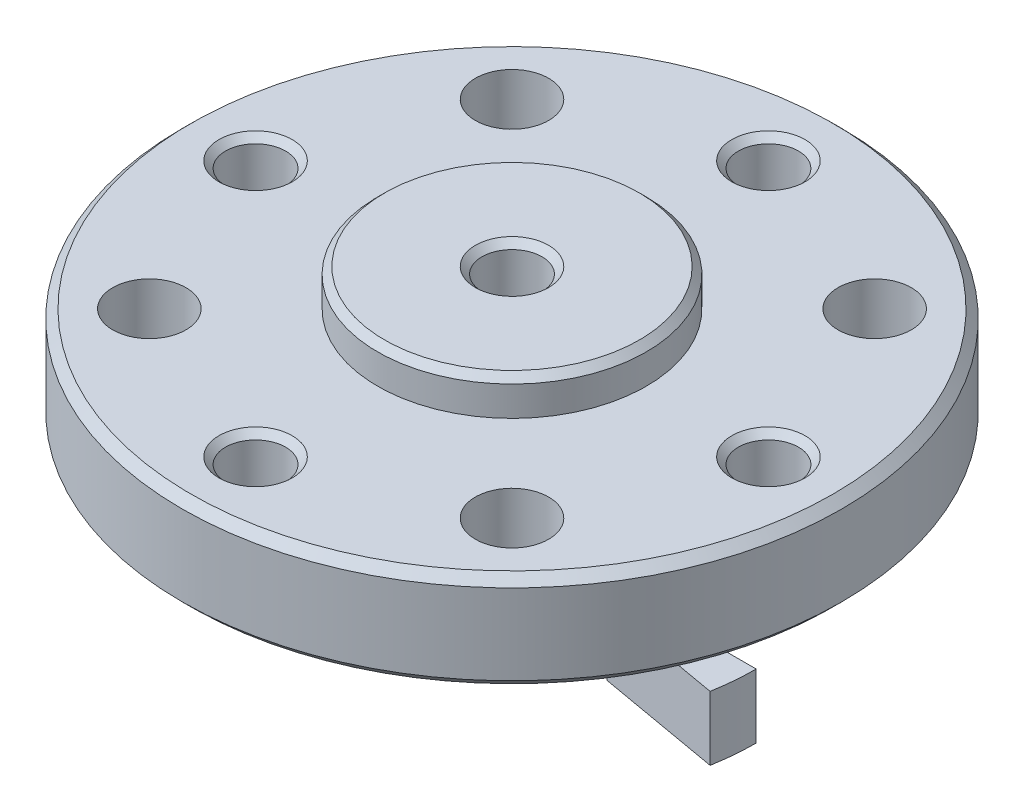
ISO-10303-21;
HEADER;
FILE_DESCRIPTION(('STEP AP214'),'2;1');
FILE_NAME('part.step','',(''),(''),'','','');
FILE_SCHEMA(('AUTOMOTIVE_DESIGN { 1 0 10303 214 1 1 1 1 }'));
ENDSEC;
DATA;
#1=APPLICATION_CONTEXT('core data for automotive mechanical design processes');
#2=APPLICATION_PROTOCOL_DEFINITION('international standard','automotive_design',2000,#1);
#3=PRODUCT_CONTEXT('',#1,'mechanical');
#4=PRODUCT('Part','Part','',(#3));
#5=PRODUCT_RELATED_PRODUCT_CATEGORY('part','',(#4));
#6=PRODUCT_DEFINITION_FORMATION('','',#4);
#7=PRODUCT_DEFINITION_CONTEXT('part definition',#1,'design');
#8=PRODUCT_DEFINITION('design','',#6,#7);
#9=PRODUCT_DEFINITION_SHAPE('','',#8);
#10=(LENGTH_UNIT() NAMED_UNIT(*) SI_UNIT(.MILLI.,.METRE.));
#11=(NAMED_UNIT(*) PLANE_ANGLE_UNIT() SI_UNIT($,.RADIAN.));
#12=(NAMED_UNIT(*) SI_UNIT($,.STERADIAN.) SOLID_ANGLE_UNIT());
#13=UNCERTAINTY_MEASURE_WITH_UNIT(LENGTH_MEASURE(1.E-05),#10,'distance_accuracy_value','');
#14=(GEOMETRIC_REPRESENTATION_CONTEXT(3) GLOBAL_UNCERTAINTY_ASSIGNED_CONTEXT((#13)) GLOBAL_UNIT_ASSIGNED_CONTEXT((#10,
#11,#12)) REPRESENTATION_CONTEXT('',''));
#15=CARTESIAN_POINT('',(0.,0.,0.));
#16=DIRECTION('',(0.,0.,1.));
#17=DIRECTION('',(1.,0.,0.));
#18=AXIS2_PLACEMENT_3D('',#15,#16,#17);
#19=CARTESIAN_POINT('',(0.,18.2,-44.6585786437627));
#20=DIRECTION('',(0.,1.,0.));
#21=DIRECTION('',(0.,0.,1.));
#22=AXIS2_PLACEMENT_3D('',#19,#20,#21);
#23=PLANE('',#22);
#24=CARTESIAN_POINT('',(0.,18.1999999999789,-42.05));
#25=DIRECTION('',(0.,-1.,0.));
#26=DIRECTION('',(0.,0.,-1.));
#27=AXIS2_PLACEMENT_3D('',#24,#25,#26);
#28=CIRCLE('',#27,5.21715728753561);
#29=CARTESIAN_POINT('',(0.,18.1999999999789,-47.2671572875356));
#30=VERTEX_POINT('',#29);
#31=EDGE_CURVE('E163',#30,#30,#28,.T.);
#32=ORIENTED_EDGE('',*,*,#31,.F.);
#33=EDGE_LOOP('',(#32));
#34=FACE_BOUND('',#33,.T.);
#35=CARTESIAN_POINT('',(0.,18.1999999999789,-42.05));
#36=DIRECTION('',(0.,1.,0.));
#37=DIRECTION('',(0.,0.,1.));
#38=AXIS2_PLACEMENT_3D('',#35,#36,#37);
#39=CIRCLE('',#38,1.50000000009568);
#40=CARTESIAN_POINT('',(0.,18.1999999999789,-40.5499999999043));
#41=VERTEX_POINT('',#40);
#42=EDGE_CURVE('E19',#41,#41,#39,.F.);
#43=ORIENTED_EDGE('',*,*,#42,.T.);
#44=EDGE_LOOP('',(#43));
#45=FACE_BOUND('',#44,.T.);
#46=ADVANCED_FACE('F16',(#34,#45),#23,.T.);
#47=CARTESIAN_POINT('',(7.4,7.6125,-42.05));
#48=DIRECTION('',(0.,0.,1.));
#49=DIRECTION('',(0.,-1.,0.));
#50=AXIS2_PLACEMENT_3D('',#47,#48,#49);
#51=PLANE('',#50);
#52=DIRECTION('',(1.,0.,0.));
#53=VECTOR('',#52,1.);
#54=CARTESIAN_POINT('',(7.28757737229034,8.925,-42.05));
#55=LINE('',#54,#53);
#56=CARTESIAN_POINT('',(10.,8.925,-42.05));
#57=VERTEX_POINT('',#56);
#58=CARTESIAN_POINT('',(5.,8.925,-42.05));
#59=VERTEX_POINT('',#58);
#60=EDGE_CURVE('E208',#57,#59,#55,.F.);
#61=ORIENTED_EDGE('',*,*,#60,.F.);
#62=DIRECTION('',(0.,-1.,0.));
#63=VECTOR('',#62,1.);
#64=CARTESIAN_POINT('',(10.,7.6125,-42.05));
#65=LINE('',#64,#63);
#66=CARTESIAN_POINT('',(10.,6.3,-42.05));
#67=VERTEX_POINT('',#66);
#68=EDGE_CURVE('E239',#67,#57,#65,.F.);
#69=ORIENTED_EDGE('',*,*,#68,.F.);
#70=DIRECTION('',(1.,0.,0.));
#71=VECTOR('',#70,1.);
#72=CARTESIAN_POINT('',(7.28757737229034,6.3,-42.05));
#73=LINE('',#72,#71);
#74=CARTESIAN_POINT('',(4.8,6.3,-42.05));
#75=VERTEX_POINT('',#74);
#76=EDGE_CURVE('E224',#75,#67,#73,.T.);
#77=ORIENTED_EDGE('',*,*,#76,.F.);
#78=DIRECTION('',(0.,-1.,0.));
#79=VECTOR('',#78,1.);
#80=CARTESIAN_POINT('',(4.8,7.6125,-42.05));
#81=LINE('',#80,#79);
#82=CARTESIAN_POINT('',(4.8,8.3,-42.05));
#83=VERTEX_POINT('',#82);
#84=EDGE_CURVE('E242',#75,#83,#81,.F.);
#85=ORIENTED_EDGE('',*,*,#84,.T.);
#86=DIRECTION('',(1.,0.,0.));
#87=VECTOR('',#86,1.);
#88=CARTESIAN_POINT('',(7.4,8.3,-42.05));
#89=LINE('',#88,#87);
#90=CARTESIAN_POINT('',(5.,8.3,-42.05));
#91=VERTEX_POINT('',#90);
#92=EDGE_CURVE('E238',#91,#83,#89,.F.);
#93=ORIENTED_EDGE('',*,*,#92,.F.);
#94=DIRECTION('',(0.,-1.,0.));
#95=VECTOR('',#94,1.);
#96=CARTESIAN_POINT('',(5.,7.6125,-42.05));
#97=LINE('',#96,#95);
#98=EDGE_CURVE('E235',#59,#91,#97,.T.);
#99=ORIENTED_EDGE('',*,*,#98,.F.);
#100=EDGE_LOOP('',(#61,#69,#77,#85,#93,#99));
#101=FACE_BOUND('',#100,.T.);
#102=ADVANCED_FACE('F506',(#101),#51,.F.);
#103=CARTESIAN_POINT('',(0.,18.1999999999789,-42.05));
#104=DIRECTION('',(0.,1.,0.));
#105=DIRECTION('',(0.,0.,1.));
#106=AXIS2_PLACEMENT_3D('',#103,#104,#105);
#107=CONICAL_SURFACE('',#106,1.50000000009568,0.785398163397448);
#108=CARTESIAN_POINT('',(0.,17.9295,-42.05));
#109=DIRECTION('',(0.,-1.,0.));
#110=DIRECTION('',(0.,0.,-1.));
#111=AXIS2_PLACEMENT_3D('',#108,#109,#110);
#112=CIRCLE('',#111,1.2295);
#113=CARTESIAN_POINT('',(0.,17.9295,-43.2795));
#114=VERTEX_POINT('',#113);
#115=EDGE_CURVE('E211',#114,#114,#112,.T.);
#116=ORIENTED_EDGE('',*,*,#115,.T.);
#117=EDGE_LOOP('',(#116));
#118=FACE_BOUND('',#117,.T.);
#119=ORIENTED_EDGE('',*,*,#42,.F.);
#120=EDGE_LOOP('',(#119));
#121=FACE_BOUND('',#120,.T.);
#122=ADVANCED_FACE('F527',(#118,#121),#107,.F.);
#123=CARTESIAN_POINT('',(0.,17.9171572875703,-42.05));
#124=DIRECTION('',(0.,-1.,0.));
#125=DIRECTION('',(0.,0.,-1.));
#126=AXIS2_PLACEMENT_3D('',#123,#124,#125);
#127=CONICAL_SURFACE('',#126,5.49999999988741,0.785398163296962);
#128=ORIENTED_EDGE('',*,*,#31,.T.);
#129=EDGE_LOOP('',(#128));
#130=FACE_BOUND('',#129,.T.);
#131=CARTESIAN_POINT('',(0.,17.9171572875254,-42.05));
#132=DIRECTION('',(0.,-1.,0.));
#133=DIRECTION('',(0.,0.,-1.));
#134=AXIS2_PLACEMENT_3D('',#131,#132,#133);
#135=CIRCLE('',#134,5.5);
#136=CARTESIAN_POINT('',(0.,17.9171572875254,-47.55));
#137=VERTEX_POINT('',#136);
#138=EDGE_CURVE('E207',#137,#137,#135,.T.);
#139=ORIENTED_EDGE('',*,*,#138,.F.);
#140=EDGE_LOOP('',(#139));
#141=FACE_BOUND('',#140,.T.);
#142=ADVANCED_FACE('F519',(#130,#141),#127,.T.);
#143=CARTESIAN_POINT('',(0.,7.6125,-42.05));
#144=DIRECTION('',(0.,-1.,0.));
#145=DIRECTION('',(0.,0.,-1.));
#146=AXIS2_PLACEMENT_3D('',#143,#144,#145);
#147=CYLINDRICAL_SURFACE('',#146,4.8);
#148=ORIENTED_EDGE('',*,*,#84,.F.);
#149=CARTESIAN_POINT('',(0.,6.3,-42.05));
#150=DIRECTION('',(0.,-1.,0.));
#151=DIRECTION('',(0.,0.,-1.));
#152=AXIS2_PLACEMENT_3D('',#149,#150,#151);
#153=CIRCLE('',#152,4.8);
#154=CARTESIAN_POINT('',(4.7270772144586,6.3,-41.2164887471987));
#155=VERTEX_POINT('',#154);
#156=EDGE_CURVE('E227',#155,#75,#153,.F.);
#157=ORIENTED_EDGE('',*,*,#156,.F.);
#158=DIRECTION('',(0.,1.,0.));
#159=VECTOR('',#158,1.);
#160=CARTESIAN_POINT('',(4.7270772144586,7.6125,-41.2164887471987));
#161=LINE('',#160,#159);
#162=CARTESIAN_POINT('',(4.7270772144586,8.3,-41.2164887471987));
#163=VERTEX_POINT('',#162);
#164=EDGE_CURVE('E223',#163,#155,#161,.F.);
#165=ORIENTED_EDGE('',*,*,#164,.F.);
#166=CARTESIAN_POINT('',(0.,8.3,-42.05));
#167=DIRECTION('',(0.,-1.,0.));
#168=DIRECTION('',(0.,0.,-1.));
#169=AXIS2_PLACEMENT_3D('',#166,#167,#168);
#170=CIRCLE('',#169,4.8);
#171=EDGE_CURVE('E228',#83,#163,#170,.T.);
#172=ORIENTED_EDGE('',*,*,#171,.F.);
#173=EDGE_LOOP('',(#148,#157,#165,#172));
#174=FACE_BOUND('',#173,.T.);
#175=ADVANCED_FACE('F512',(#174),#147,.F.);
#176=CARTESIAN_POINT('',(7.28757737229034,6.3,-40.7650034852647));
#177=DIRECTION('',(0.,-1.,0.));
#178=DIRECTION('',(0.,0.,-1.));
#179=AXIS2_PLACEMENT_3D('',#176,#177,#178);
#180=PLANE('',#179);
#181=DIRECTION('',(0.984807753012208,0.,0.17364817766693));
#182=VECTOR('',#181,1.);
#183=CARTESIAN_POINT('',(7.28757737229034,6.3,-40.7650034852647));
#184=LINE('',#183,#182);
#185=CARTESIAN_POINT('',(9.84807753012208,6.3,-40.3135182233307));
#186=VERTEX_POINT('',#185);
#187=EDGE_CURVE('E217',#155,#186,#184,.T.);
#188=ORIENTED_EDGE('',*,*,#187,.F.);
#189=ORIENTED_EDGE('',*,*,#156,.T.);
#190=ORIENTED_EDGE('',*,*,#76,.T.);
#191=CARTESIAN_POINT('',(0.,6.3,-42.05));
#192=DIRECTION('',(0.,-1.,0.));
#193=DIRECTION('',(0.,0.,-1.));
#194=AXIS2_PLACEMENT_3D('',#191,#192,#193);
#195=CIRCLE('',#194,10.);
#196=EDGE_CURVE('E241',#186,#67,#195,.F.);
#197=ORIENTED_EDGE('',*,*,#196,.F.);
#198=EDGE_LOOP('',(#188,#189,#190,#197));
#199=FACE_BOUND('',#198,.T.);
#200=ADVANCED_FACE('F539',(#199),#180,.T.);
#201=CARTESIAN_POINT('',(0.,7.6125,-42.05));
#202=DIRECTION('',(0.,-1.,0.));
#203=DIRECTION('',(0.,0.,-1.));
#204=AXIS2_PLACEMENT_3D('',#201,#202,#203);
#205=CYLINDRICAL_SURFACE('',#204,10.);
#206=DIRECTION('',(0.,1.,0.));
#207=VECTOR('',#206,1.);
#208=CARTESIAN_POINT('',(9.84807753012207,7.6125,-40.3135182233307));
#209=LINE('',#208,#207);
#210=CARTESIAN_POINT('',(9.84807753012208,8.925,-40.3135182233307));
#211=VERTEX_POINT('',#210);
#212=EDGE_CURVE('E213',#186,#211,#209,.T.);
#213=ORIENTED_EDGE('',*,*,#212,.F.);
#214=ORIENTED_EDGE('',*,*,#196,.T.);
#215=ORIENTED_EDGE('',*,*,#68,.T.);
#216=CARTESIAN_POINT('',(0.,8.925,-42.05));
#217=DIRECTION('',(0.,-1.,0.));
#218=DIRECTION('',(0.,0.,-1.));
#219=AXIS2_PLACEMENT_3D('',#216,#217,#218);
#220=CIRCLE('',#219,10.);
#221=EDGE_CURVE('E212',#211,#57,#220,.F.);
#222=ORIENTED_EDGE('',*,*,#221,.F.);
#223=EDGE_LOOP('',(#213,#214,#215,#222));
#224=FACE_BOUND('',#223,.T.);
#225=ADVANCED_FACE('F542',(#224),#205,.T.);
#226=CARTESIAN_POINT('',(7.28757737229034,8.925,-40.7650034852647));
#227=DIRECTION('',(0.,1.,0.));
#228=DIRECTION('',(0.,0.,1.));
#229=AXIS2_PLACEMENT_3D('',#226,#227,#228);
#230=PLANE('',#229);
#231=ORIENTED_EDGE('',*,*,#221,.T.);
#232=ORIENTED_EDGE('',*,*,#60,.T.);
#233=CARTESIAN_POINT('',(0.,8.925,-42.05));
#234=DIRECTION('',(0.,-1.,0.));
#235=DIRECTION('',(0.,0.,-1.));
#236=AXIS2_PLACEMENT_3D('',#233,#234,#235);
#237=CIRCLE('',#236,5.);
#238=CARTESIAN_POINT('',(4.92403876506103,8.925,-41.1817591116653));
#239=VERTEX_POINT('',#238);
#240=EDGE_CURVE('E502',#59,#239,#237,.T.);
#241=ORIENTED_EDGE('',*,*,#240,.T.);
#242=DIRECTION('',(0.984807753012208,0.,0.17364817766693));
#243=VECTOR('',#242,1.);
#244=CARTESIAN_POINT('',(7.28757737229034,8.925,-40.7650034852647));
#245=LINE('',#244,#243);
#246=EDGE_CURVE('E216',#211,#239,#245,.F.);
#247=ORIENTED_EDGE('',*,*,#246,.F.);
#248=EDGE_LOOP('',(#231,#232,#241,#247));
#249=FACE_BOUND('',#248,.T.);
#250=ADVANCED_FACE('F546',(#249),#230,.T.);
#251=CARTESIAN_POINT('',(0.,13.25,-42.05));
#252=DIRECTION('',(0.,-1.,0.));
#253=DIRECTION('',(0.,0.,-1.));
#254=AXIS2_PLACEMENT_3D('',#251,#252,#253);
#255=CYLINDRICAL_SURFACE('',#254,1.2295);
#256=CARTESIAN_POINT('',(0.,10.3,-42.05));
#257=DIRECTION('',(0.,-1.,0.));
#258=DIRECTION('',(0.,0.,-1.));
#259=AXIS2_PLACEMENT_3D('',#256,#257,#258);
#260=CIRCLE('',#259,1.2295);
#261=CARTESIAN_POINT('',(0.999999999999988,10.3,-41.3346887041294));
#262=VERTEX_POINT('',#261);
#263=CARTESIAN_POINT('',(-0.999999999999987,10.3,-41.3346887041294));
#264=VERTEX_POINT('',#263);
#265=EDGE_CURVE('E138',#262,#264,#260,.T.);
#266=ORIENTED_EDGE('',*,*,#265,.T.);
#267=DIRECTION('',(0.,-1.,0.));
#268=VECTOR('',#267,1.);
#269=CARTESIAN_POINT('',(-0.999999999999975,13.25,-41.3346887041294));
#270=LINE('',#269,#268);
#271=CARTESIAN_POINT('',(-1.,8.5705000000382,-41.3346887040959));
#272=VERTEX_POINT('',#271);
#273=EDGE_CURVE('E143',#272,#264,#270,.F.);
#274=ORIENTED_EDGE('',*,*,#273,.F.);
#275=CARTESIAN_POINT('',(0.,8.5705,-42.05));
#276=DIRECTION('',(0.,-1.,0.));
#277=DIRECTION('',(0.,0.,-1.));
#278=AXIS2_PLACEMENT_3D('',#275,#276,#277);
#279=CIRCLE('',#278,1.2295);
#280=CARTESIAN_POINT('',(-1.00000000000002,8.57050000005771,-42.7653112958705));
#281=VERTEX_POINT('',#280);
#282=EDGE_CURVE('E164',#281,#272,#279,.F.);
#283=ORIENTED_EDGE('',*,*,#282,.F.);
#284=DIRECTION('',(0.,-1.,0.));
#285=VECTOR('',#284,1.);
#286=CARTESIAN_POINT('',(-1.00000000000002,13.25,-42.7653112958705));
#287=LINE('',#286,#285);
#288=CARTESIAN_POINT('',(-1.00000000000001,10.3,-42.7653112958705));
#289=VERTEX_POINT('',#288);
#290=EDGE_CURVE('E247',#289,#281,#287,.T.);
#291=ORIENTED_EDGE('',*,*,#290,.F.);
#292=CARTESIAN_POINT('',(0.,10.3,-42.05));
#293=DIRECTION('',(0.,-1.,0.));
#294=DIRECTION('',(0.,0.,-1.));
#295=AXIS2_PLACEMENT_3D('',#292,#293,#294);
#296=CIRCLE('',#295,1.2295);
#297=CARTESIAN_POINT('',(1.00000000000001,10.3,-42.7653112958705));
#298=VERTEX_POINT('',#297);
#299=EDGE_CURVE('E220',#289,#298,#296,.T.);
#300=ORIENTED_EDGE('',*,*,#299,.T.);
#301=DIRECTION('',(0.,-1.,0.));
#302=VECTOR('',#301,1.);
#303=CARTESIAN_POINT('',(1.00000000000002,13.25,-42.7653112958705));
#304=LINE('',#303,#302);
#305=CARTESIAN_POINT('',(1.00000000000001,8.57050000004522,-42.7653112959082));
#306=VERTEX_POINT('',#305);
#307=EDGE_CURVE('E205',#306,#298,#304,.F.);
#308=ORIENTED_EDGE('',*,*,#307,.F.);
#309=CARTESIAN_POINT('',(0.,8.57050000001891,-42.05));
#310=DIRECTION('',(0.,-1.,0.));
#311=DIRECTION('',(0.,0.,-1.));
#312=AXIS2_PLACEMENT_3D('',#309,#310,#311);
#313=CIRCLE('',#312,1.22950000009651);
#314=CARTESIAN_POINT('',(0.999999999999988,8.57050000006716,-41.3346887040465));
#315=VERTEX_POINT('',#314);
#316=EDGE_CURVE('E468',#306,#315,#313,.T.);
#317=ORIENTED_EDGE('',*,*,#316,.T.);
#318=DIRECTION('',(0.,-1.,0.));
#319=VECTOR('',#318,1.);
#320=CARTESIAN_POINT('',(0.999999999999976,13.25,-41.3346887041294));
#321=LINE('',#320,#319);
#322=EDGE_CURVE('E146',#262,#315,#321,.T.);
#323=ORIENTED_EDGE('',*,*,#322,.F.);
#324=EDGE_LOOP('',(#266,#274,#283,#291,#300,#308,#317,#323));
#325=FACE_BOUND('',#324,.T.);
#326=ORIENTED_EDGE('',*,*,#115,.F.);
#327=EDGE_LOOP('',(#326));
#328=FACE_BOUND('',#327,.T.);
#329=ADVANCED_FACE('F140',(#325,#328),#255,.F.);
#330=CARTESIAN_POINT('',(0.,17.3085786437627,-42.05));
#331=DIRECTION('',(0.,-1.,0.));
#332=DIRECTION('',(0.,0.,-1.));
#333=AXIS2_PLACEMENT_3D('',#330,#331,#332);
#334=CYLINDRICAL_SURFACE('',#333,5.5);
#335=ORIENTED_EDGE('',*,*,#138,.T.);
#336=EDGE_LOOP('',(#335));
#337=FACE_BOUND('',#336,.T.);
#338=CARTESIAN_POINT('',(0.,16.7,-42.05));
#339=DIRECTION('',(0.,-1.,0.));
#340=DIRECTION('',(0.,0.,-1.));
#341=AXIS2_PLACEMENT_3D('',#338,#339,#340);
#342=CIRCLE('',#341,5.5);
#343=CARTESIAN_POINT('',(0.,16.7,-47.55));
#344=VERTEX_POINT('',#343);
#345=EDGE_CURVE('E714',#344,#344,#342,.T.);
#346=ORIENTED_EDGE('',*,*,#345,.F.);
#347=EDGE_LOOP('',(#346));
#348=FACE_BOUND('',#347,.T.);
#349=ADVANCED_FACE('F553',(#337,#348),#334,.T.);
#350=CARTESIAN_POINT('',(0.,16.6999999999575,-52.55));
#351=DIRECTION('',(0.,1.,0.));
#352=DIRECTION('',(0.,0.,1.));
#353=AXIS2_PLACEMENT_3D('',#350,#351,#352);
#354=CONICAL_SURFACE('',#353,1.49999999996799,0.785398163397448);
#355=CARTESIAN_POINT('',(0.,16.4295,-52.55));
#356=DIRECTION('',(0.,1.,0.));
#357=DIRECTION('',(0.,0.,1.));
#358=AXIS2_PLACEMENT_3D('',#355,#356,#357);
#359=CIRCLE('',#358,1.2295);
#360=CARTESIAN_POINT('',(0.,16.4295,-51.3205));
#361=VERTEX_POINT('',#360);
#362=EDGE_CURVE('E201',#361,#361,#359,.F.);
#363=ORIENTED_EDGE('',*,*,#362,.T.);
#364=EDGE_LOOP('',(#363));
#365=FACE_BOUND('',#364,.T.);
#366=CARTESIAN_POINT('',(0.,16.7000000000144,-52.55));
#367=DIRECTION('',(0.,1.,0.));
#368=DIRECTION('',(0.,0.,1.));
#369=AXIS2_PLACEMENT_3D('',#366,#367,#368);
#370=CIRCLE('',#369,1.50000000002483);
#371=CARTESIAN_POINT('',(0.,16.7000000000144,-51.0499999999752));
#372=VERTEX_POINT('',#371);
#373=EDGE_CURVE('E618',#372,#372,#370,.F.);
#374=ORIENTED_EDGE('',*,*,#373,.F.);
#375=EDGE_LOOP('',(#374));
#376=FACE_BOUND('',#375,.T.);
#377=ADVANCED_FACE('F556',(#365,#376),#354,.F.);
#378=CARTESIAN_POINT('',(0.,16.7000000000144,-31.55));
#379=DIRECTION('',(0.,1.,0.));
#380=DIRECTION('',(0.,0.,1.));
#381=AXIS2_PLACEMENT_3D('',#378,#379,#380);
#382=CONICAL_SURFACE('',#381,1.50000000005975,0.785398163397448);
#383=CARTESIAN_POINT('',(0.,16.4295,-31.55));
#384=DIRECTION('',(0.,-1.,0.));
#385=DIRECTION('',(0.,0.,-1.));
#386=AXIS2_PLACEMENT_3D('',#383,#384,#385);
#387=CIRCLE('',#386,1.2295);
#388=CARTESIAN_POINT('',(0.,16.4295,-32.7795));
#389=VERTEX_POINT('',#388);
#390=EDGE_CURVE('E198',#389,#389,#387,.T.);
#391=ORIENTED_EDGE('',*,*,#390,.T.);
#392=EDGE_LOOP('',(#391));
#393=FACE_BOUND('',#392,.T.);
#394=CARTESIAN_POINT('',(0.,16.7000000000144,-31.55));
#395=DIRECTION('',(0.,1.,0.));
#396=DIRECTION('',(0.,0.,1.));
#397=AXIS2_PLACEMENT_3D('',#394,#395,#396);
#398=CIRCLE('',#397,1.50000000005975);
#399=CARTESIAN_POINT('',(0.,16.7000000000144,-30.0499999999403));
#400=VERTEX_POINT('',#399);
#401=EDGE_CURVE('E620',#400,#400,#398,.F.);
#402=ORIENTED_EDGE('',*,*,#401,.F.);
#403=EDGE_LOOP('',(#402));
#404=FACE_BOUND('',#403,.T.);
#405=ADVANCED_FACE('F560',(#393,#404),#382,.F.);
#406=CARTESIAN_POINT('',(-10.5,16.7000000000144,-42.05));
#407=DIRECTION('',(0.,1.,0.));
#408=DIRECTION('',(0.,0.,1.));
#409=AXIS2_PLACEMENT_3D('',#406,#407,#408);
#410=CONICAL_SURFACE('',#409,1.50000000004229,0.785398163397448);
#411=CARTESIAN_POINT('',(-10.5,16.4295,-42.05));
#412=DIRECTION('',(0.,-1.,0.));
#413=DIRECTION('',(0.,0.,-1.));
#414=AXIS2_PLACEMENT_3D('',#411,#412,#413);
#415=CIRCLE('',#414,1.2295);
#416=CARTESIAN_POINT('',(-10.5,16.4295,-43.2795));
#417=VERTEX_POINT('',#416);
#418=EDGE_CURVE('E195',#417,#417,#415,.T.);
#419=ORIENTED_EDGE('',*,*,#418,.T.);
#420=EDGE_LOOP('',(#419));
#421=FACE_BOUND('',#420,.T.);
#422=CARTESIAN_POINT('',(-10.5,16.7000000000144,-42.05));
#423=DIRECTION('',(0.,1.,0.));
#424=DIRECTION('',(0.,0.,1.));
#425=AXIS2_PLACEMENT_3D('',#422,#423,#424);
#426=CIRCLE('',#425,1.50000000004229);
#427=CARTESIAN_POINT('',(-10.5,16.7000000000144,-40.5499999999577));
#428=VERTEX_POINT('',#427);
#429=EDGE_CURVE('E623',#428,#428,#426,.F.);
#430=ORIENTED_EDGE('',*,*,#429,.F.);
#431=EDGE_LOOP('',(#430));
#432=FACE_BOUND('',#431,.T.);
#433=ADVANCED_FACE('F564',(#421,#432),#410,.F.);
#434=CARTESIAN_POINT('',(10.5,16.7000000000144,-42.05));
#435=DIRECTION('',(0.,1.,0.));
#436=DIRECTION('',(0.,0.,1.));
#437=AXIS2_PLACEMENT_3D('',#434,#435,#436);
#438=CONICAL_SURFACE('',#437,1.50000000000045,0.785398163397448);
#439=CARTESIAN_POINT('',(10.5,16.4295,-42.05));
#440=DIRECTION('',(0.,-1.,0.));
#441=DIRECTION('',(0.,0.,-1.));
#442=AXIS2_PLACEMENT_3D('',#439,#440,#441);
#443=CIRCLE('',#442,1.2295);
#444=CARTESIAN_POINT('',(10.5,16.4295,-43.2795));
#445=VERTEX_POINT('',#444);
#446=EDGE_CURVE('E192',#445,#445,#443,.T.);
#447=ORIENTED_EDGE('',*,*,#446,.T.);
#448=EDGE_LOOP('',(#447));
#449=FACE_BOUND('',#448,.T.);
#450=CARTESIAN_POINT('',(10.5,16.7000000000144,-42.05));
#451=DIRECTION('',(0.,1.,0.));
#452=DIRECTION('',(0.,0.,1.));
#453=AXIS2_PLACEMENT_3D('',#450,#451,#452);
#454=CIRCLE('',#453,1.50000000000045);
#455=CARTESIAN_POINT('',(10.5,16.7000000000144,-40.5499999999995));
#456=VERTEX_POINT('',#455);
#457=EDGE_CURVE('E718',#456,#456,#454,.F.);
#458=ORIENTED_EDGE('',*,*,#457,.F.);
#459=EDGE_LOOP('',(#458));
#460=FACE_BOUND('',#459,.T.);
#461=ADVANCED_FACE('F568',(#449,#460),#438,.F.);
#462=CARTESIAN_POINT('',(0.,16.3464466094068,-42.05));
#463=DIRECTION('',(0.,-1.,0.));
#464=DIRECTION('',(1.,0.,0.));
#465=AXIS2_PLACEMENT_3D('',#462,#463,#464);
#466=CONICAL_SURFACE('',#465,13.5,0.785398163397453);
#467=CARTESIAN_POINT('',(0.,16.7,-42.05));
#468=DIRECTION('',(0.,-1.,0.));
#469=DIRECTION('',(1.,0.,0.));
#470=AXIS2_PLACEMENT_3D('',#467,#468,#469);
#471=CIRCLE('',#470,13.1464466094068);
#472=CARTESIAN_POINT('',(13.1464466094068,16.7,-42.05));
#473=VERTEX_POINT('',#472);
#474=EDGE_CURVE('E204',#473,#473,#471,.F.);
#475=ORIENTED_EDGE('',*,*,#474,.F.);
#476=EDGE_LOOP('',(#475));
#477=FACE_BOUND('',#476,.T.);
#478=CARTESIAN_POINT('',(0.,16.3464466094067,-42.05));
#479=DIRECTION('',(0.,-1.,0.));
#480=DIRECTION('',(0.,0.,-1.));
#481=AXIS2_PLACEMENT_3D('',#478,#479,#480);
#482=CIRCLE('',#481,13.5);
#483=CARTESIAN_POINT('',(0.,16.3464466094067,-55.55));
#484=VERTEX_POINT('',#483);
#485=EDGE_CURVE('E189',#484,#484,#482,.T.);
#486=ORIENTED_EDGE('',*,*,#485,.F.);
#487=EDGE_LOOP('',(#486));
#488=FACE_BOUND('',#487,.T.);
#489=ADVANCED_FACE('F571',(#477,#488),#466,.T.);
#490=CARTESIAN_POINT('',(-1.,8.5,-37.05));
#491=DIRECTION('',(-0.707106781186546,0.707106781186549,0.));
#492=DIRECTION('',(-0.707106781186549,-0.707106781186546,0.));
#493=AXIS2_PLACEMENT_3D('',#490,#491,#492);
#494=PLANE('',#493);
#495=DIRECTION('',(0.,0.,1.));
#496=VECTOR('',#495,1.);
#497=CARTESIAN_POINT('',(-1.,8.5,-37.05));
#498=LINE('',#497,#496);
#499=CARTESIAN_POINT('',(-0.999999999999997,8.5,-46.9489794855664));
#500=VERTEX_POINT('',#499);
#501=CARTESIAN_POINT('',(-0.999999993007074,8.50000000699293,-42.8806623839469));
#502=VERTEX_POINT('',#501);
#503=EDGE_CURVE('E187',#500,#502,#498,.T.);
#504=ORIENTED_EDGE('',*,*,#503,.T.);
#505=CARTESIAN_POINT('',(-0.999999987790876,8.50000001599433,-42.880662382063));
#506=CARTESIAN_POINT('',(-1.03325769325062,8.46674230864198,-42.8926552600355));
#507=CARTESIAN_POINT('',(-1.06655323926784,8.43344676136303,-42.904429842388));
#508=CARTESIAN_POINT('',(-1.13321991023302,8.36678008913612,-42.9275423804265));
#509=CARTESIAN_POINT('',(-1.16659103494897,8.33340896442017,-42.938880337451));
#510=CARTESIAN_POINT('',(-1.1999999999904,8.3000000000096,-42.9500000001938));
#511=B_SPLINE_CURVE_WITH_KNOTS('',3,(#505,#506,#507,#508,#509,#510),.UNSPECIFIED.,.F.,.F.,(4,2,
4),(0.,0.145610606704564,0.291220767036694),.UNSPECIFIED.);
#512=CARTESIAN_POINT('',(-1.19999999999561,8.30000000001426,-42.9500000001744));
#513=VERTEX_POINT('',#512);
#514=EDGE_CURVE('E339',#502,#513,#511,.T.);
#515=ORIENTED_EDGE('',*,*,#514,.T.);
#516=DIRECTION('',(0.,0.,-1.));
#517=VECTOR('',#516,1.);
#518=CARTESIAN_POINT('',(-1.2,8.3,-44.55));
#519=LINE('',#518,#517);
#520=CARTESIAN_POINT('',(-1.2,8.3,-46.9038644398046));
#521=VERTEX_POINT('',#520);
#522=EDGE_CURVE('E174',#521,#513,#519,.F.);
#523=ORIENTED_EDGE('',*,*,#522,.F.);
#524=CARTESIAN_POINT('',(0.,9.5,-42.05));
#525=DIRECTION('',(-0.707106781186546,0.707106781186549,0.));
#526=DIRECTION('',(-0.707106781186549,-0.707106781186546,0.));
#527=AXIS2_PLACEMENT_3D('',#524,#525,#526);
#528=ELLIPSE('',#527,7.07106781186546,5.);
#529=EDGE_CURVE('E232',#500,#521,#528,.T.);
#530=ORIENTED_EDGE('',*,*,#529,.F.);
#531=EDGE_LOOP('',(#504,#515,#523,#530));
#532=FACE_BOUND('',#531,.T.);
#533=ADVANCED_FACE('F351',(#532),#494,.F.);
#534=CARTESIAN_POINT('',(0.,8.30000000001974,-42.05));
#535=DIRECTION('',(0.,-1.,0.));
#536=DIRECTION('',(0.,0.,-1.));
#537=AXIS2_PLACEMENT_3D('',#534,#535,#536);
#538=CONICAL_SURFACE('',#537,1.50000000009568,0.785398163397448);
#539=CARTESIAN_POINT('',(0.,8.30000000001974,-42.05));
#540=DIRECTION('',(0.,-1.,0.));
#541=DIRECTION('',(0.,0.,-1.));
#542=AXIS2_PLACEMENT_3D('',#539,#540,#541);
#543=CIRCLE('',#542,1.50000000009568);
#544=CARTESIAN_POINT('',(-1.19999999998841,8.30000000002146,-41.1499999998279));
#545=VERTEX_POINT('',#544);
#546=EDGE_CURVE('E168',#513,#545,#543,.F.);
#547=ORIENTED_EDGE('',*,*,#546,.F.);
#548=ORIENTED_EDGE('',*,*,#514,.F.);
#549=CARTESIAN_POINT('',(-0.999999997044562,8.50000002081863,-42.8806623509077));
#550=CARTESIAN_POINT('',(-0.999999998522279,8.51214988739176,-42.8616816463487));
#551=CARTESIAN_POINT('',(-0.999999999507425,8.52409980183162,-42.842578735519));
#552=CARTESIAN_POINT('',(-1.00000000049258,8.54759979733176,-42.8041283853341));
#553=CARTESIAN_POINT('',(-1.00000000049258,8.55914987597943,-42.7847809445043));
#554=CARTESIAN_POINT('',(-1.,8.57050000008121,-42.7653112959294));
#555=B_SPLINE_CURVE_WITH_KNOTS('',3,(#549,#550,#551,#552,#553,#554),.UNSPECIFIED.,.F.,.F.,(4,2,
4),(0.,0.067598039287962,0.135196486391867),.UNSPECIFIED.);
#556=EDGE_CURVE('E181',#502,#281,#555,.T.);
#557=ORIENTED_EDGE('',*,*,#556,.T.);
#558=ORIENTED_EDGE('',*,*,#282,.T.);
#559=CARTESIAN_POINT('',(-0.999999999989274,8.50000003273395,-41.2193376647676));
#560=CARTESIAN_POINT('',(-0.999999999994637,8.51214989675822,-41.2383183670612));
#561=CARTESIAN_POINT('',(-0.999999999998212,8.52409980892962,-41.2574212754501));
#562=CARTESIAN_POINT('',(-1.00000000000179,8.54759980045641,-41.295871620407));
#563=CARTESIAN_POINT('',(-1.00000000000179,8.5591498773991,-41.3152190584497));
#564=CARTESIAN_POINT('',(-1.,8.57050000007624,-41.3346887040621));
#565=B_SPLINE_CURVE_WITH_KNOTS('',3,(#559,#560,#561,#562,#563,#564),.UNSPECIFIED.,.F.,.F.,(4,2,
4),(0.,0.0675980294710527,0.135196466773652),.UNSPECIFIED.);
#566=CARTESIAN_POINT('',(-0.999999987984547,8.50000002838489,-41.2193376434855));
#567=VERTEX_POINT('',#566);
#568=EDGE_CURVE('E162',#567,#272,#565,.T.);
#569=ORIENTED_EDGE('',*,*,#568,.F.);
#570=CARTESIAN_POINT('',(-0.999999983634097,8.50000003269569,-41.2193376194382));
#571=CARTESIAN_POINT('',(-1.03325768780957,8.46674232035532,-41.20734474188));
#572=CARTESIAN_POINT('',(-1.06655323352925,8.43344676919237,-41.1955701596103));
#573=CARTESIAN_POINT('',(-1.13321990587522,8.36678009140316,-41.1724576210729));
#574=CARTESIAN_POINT('',(-1.16659103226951,8.33340896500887,-41.1611196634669));
#575=CARTESIAN_POINT('',(-1.199999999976,8.300000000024,-41.149999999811));
#576=B_SPLINE_CURVE_WITH_KNOTS('',3,(#570,#571,#572,#573,#574,#575),.UNSPECIFIED.,.F.,.F.,(4,2,
4),(0.,0.145610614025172,0.291220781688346),.UNSPECIFIED.);
#577=EDGE_CURVE('E364',#567,#545,#576,.T.);
#578=ORIENTED_EDGE('',*,*,#577,.T.);
#579=EDGE_LOOP('',(#547,#548,#557,#558,#569,#578));
#580=FACE_BOUND('',#579,.T.);
#581=ADVANCED_FACE('F346',(#580),#538,.F.);
#582=CARTESIAN_POINT('',(-1.,8.5,-37.05));
#583=DIRECTION('',(-0.707106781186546,0.707106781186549,0.));
#584=DIRECTION('',(-0.707106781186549,-0.707106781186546,0.));
#585=AXIS2_PLACEMENT_3D('',#582,#583,#584);
#586=PLANE('',#585);
#587=DIRECTION('',(0.,0.,-1.));
#588=VECTOR('',#587,1.);
#589=CARTESIAN_POINT('',(-1.2,8.3,-44.55));
#590=LINE('',#589,#588);
#591=CARTESIAN_POINT('',(-1.2,8.3,-37.1961355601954));
#592=VERTEX_POINT('',#591);
#593=EDGE_CURVE('E180',#545,#592,#590,.F.);
#594=ORIENTED_EDGE('',*,*,#593,.F.);
#595=ORIENTED_EDGE('',*,*,#577,.F.);
#596=DIRECTION('',(0.,0.,1.));
#597=VECTOR('',#596,1.);
#598=CARTESIAN_POINT('',(-1.,8.5,-37.05));
#599=LINE('',#598,#597);
#600=CARTESIAN_POINT('',(-0.999999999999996,8.5,-37.1510205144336));
#601=VERTEX_POINT('',#600);
#602=EDGE_CURVE('E167',#567,#601,#599,.T.);
#603=ORIENTED_EDGE('',*,*,#602,.T.);
#604=CARTESIAN_POINT('',(0.,9.5,-42.05));
#605=DIRECTION('',(-0.707106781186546,0.707106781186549,0.));
#606=DIRECTION('',(-0.707106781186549,-0.707106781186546,0.));
#607=AXIS2_PLACEMENT_3D('',#604,#605,#606);
#608=ELLIPSE('',#607,7.07106781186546,5.);
#609=EDGE_CURVE('E152',#592,#601,#608,.T.);
#610=ORIENTED_EDGE('',*,*,#609,.F.);
#611=EDGE_LOOP('',(#594,#595,#603,#610));
#612=FACE_BOUND('',#611,.T.);
#613=ADVANCED_FACE('F350',(#612),#586,.F.);
#614=CARTESIAN_POINT('',(1.,10.3,-37.05));
#615=DIRECTION('',(0.,1.,0.));
#616=DIRECTION('',(0.,0.,1.));
#617=AXIS2_PLACEMENT_3D('',#614,#615,#616);
#618=PLANE('',#617);
#619=DIRECTION('',(0.,0.,1.));
#620=VECTOR('',#619,1.);
#621=CARTESIAN_POINT('',(-1.,10.3,-37.05));
#622=LINE('',#621,#620);
#623=CARTESIAN_POINT('',(-0.999999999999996,10.3,-37.1510205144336));
#624=VERTEX_POINT('',#623);
#625=EDGE_CURVE('E160',#624,#264,#622,.F.);
#626=ORIENTED_EDGE('',*,*,#625,.T.);
#627=ORIENTED_EDGE('',*,*,#265,.F.);
#628=DIRECTION('',(0.,0.,-1.));
#629=VECTOR('',#628,1.);
#630=CARTESIAN_POINT('',(1.,10.3,-37.05));
#631=LINE('',#630,#629);
#632=CARTESIAN_POINT('',(0.999999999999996,10.3,-37.1510205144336));
#633=VERTEX_POINT('',#632);
#634=EDGE_CURVE('E313',#262,#633,#631,.F.);
#635=ORIENTED_EDGE('',*,*,#634,.T.);
#636=CARTESIAN_POINT('',(0.,10.3,-42.05));
#637=DIRECTION('',(0.,-1.,0.));
#638=DIRECTION('',(0.,0.,-1.));
#639=AXIS2_PLACEMENT_3D('',#636,#637,#638);
#640=CIRCLE('',#639,5.);
#641=EDGE_CURVE('E151',#624,#633,#640,.F.);
#642=ORIENTED_EDGE('',*,*,#641,.F.);
#643=EDGE_LOOP('',(#626,#627,#635,#642));
#644=FACE_BOUND('',#643,.T.);
#645=ADVANCED_FACE('F166',(#644),#618,.F.);
#646=CARTESIAN_POINT('',(1.2,8.3,-37.05));
#647=DIRECTION('',(0.707106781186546,0.707106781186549,0.));
#648=DIRECTION('',(-0.707106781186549,0.707106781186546,0.));
#649=AXIS2_PLACEMENT_3D('',#646,#647,#648);
#650=PLANE('',#649);
#651=DIRECTION('',(0.,0.,-1.));
#652=VECTOR('',#651,1.);
#653=CARTESIAN_POINT('',(1.,8.5,-37.05));
#654=LINE('',#653,#652);
#655=CARTESIAN_POINT('',(0.999999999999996,8.5,-37.1510205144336));
#656=VERTEX_POINT('',#655);
#657=CARTESIAN_POINT('',(1.00000006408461,8.49999993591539,-41.2193375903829));
#658=VERTEX_POINT('',#657);
#659=EDGE_CURVE('E171',#656,#658,#654,.T.);
#660=ORIENTED_EDGE('',*,*,#659,.T.);
#661=CARTESIAN_POINT('',(1.0000001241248,8.49999986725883,-41.219337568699));
#662=CARTESIAN_POINT('',(1.03325780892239,8.46674218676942,-41.2073446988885));
#663=CARTESIAN_POINT('',(1.06655333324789,8.43344666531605,-41.1955701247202));
#664=CARTESIAN_POINT('',(1.13321995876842,8.36678004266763,-41.1724576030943));
#665=CARTESIAN_POINT('',(1.16659105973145,8.3334089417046,-41.1611196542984));
#666=CARTESIAN_POINT('',(1.1999999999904,8.3000000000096,-41.1499999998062));
#667=B_SPLINE_CURVE_WITH_KNOTS('',3,(#661,#662,#663,#664,#665,#666),.UNSPECIFIED.,.F.,.F.,(4,2,
4),(0.,0.14561050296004,0.291220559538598),.UNSPECIFIED.);
#668=CARTESIAN_POINT('',(1.19999999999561,8.30000000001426,-41.1499999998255));
#669=VERTEX_POINT('',#668);
#670=EDGE_CURVE('E373',#658,#669,#667,.T.);
#671=ORIENTED_EDGE('',*,*,#670,.T.);
#672=DIRECTION('',(0.,0.,-1.));
#673=VECTOR('',#672,1.);
#674=CARTESIAN_POINT('',(1.2,8.3,-44.55));
#675=LINE('',#674,#673);
#676=CARTESIAN_POINT('',(1.2,8.3,-37.1961355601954));
#677=VERTEX_POINT('',#676);
#678=EDGE_CURVE('E305',#677,#669,#675,.T.);
#679=ORIENTED_EDGE('',*,*,#678,.F.);
#680=CARTESIAN_POINT('',(0.,9.49999999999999,-42.05));
#681=DIRECTION('',(0.707106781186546,0.707106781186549,0.));
#682=DIRECTION('',(0.707106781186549,-0.707106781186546,0.));
#683=AXIS2_PLACEMENT_3D('',#680,#681,#682);
#684=ELLIPSE('',#683,7.07106781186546,5.);
#685=EDGE_CURVE('E371',#656,#677,#684,.T.);
#686=ORIENTED_EDGE('',*,*,#685,.F.);
#687=EDGE_LOOP('',(#660,#671,#679,#686));
#688=FACE_BOUND('',#687,.T.);
#689=ADVANCED_FACE('F383',(#688),#650,.F.);
#690=CARTESIAN_POINT('',(0.,8.30000000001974,-42.05));
#691=DIRECTION('',(0.,-1.,0.));
#692=DIRECTION('',(0.,0.,-1.));
#693=AXIS2_PLACEMENT_3D('',#690,#691,#692);
#694=CONICAL_SURFACE('',#693,1.50000000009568,0.785398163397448);
#695=ORIENTED_EDGE('',*,*,#316,.F.);
#696=CARTESIAN_POINT('',(0.999999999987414,8.50000000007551,-42.8806623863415));
#697=CARTESIAN_POINT('',(0.999999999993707,8.5121498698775,-42.8616816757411));
#698=CARTESIAN_POINT('',(0.999999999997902,8.52409978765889,-42.8425787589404));
#699=CARTESIAN_POINT('',(1.0000000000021,8.54759979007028,-42.8041283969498));
#700=CARTESIAN_POINT('',(1.0000000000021,8.55914987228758,-42.7847809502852));
#701=CARTESIAN_POINT('',(1.,8.57050000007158,-42.7653112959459));
#702=B_SPLINE_CURVE_WITH_KNOTS('',3,(#696,#697,#698,#699,#700,#701),.UNSPECIFIED.,.F.,.F.,(4,2,
4),(0.,0.0675980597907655,0.135196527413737),.UNSPECIFIED.);
#703=CARTESIAN_POINT('',(0.999999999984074,8.50000000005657,-42.8806623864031));
#704=VERTEX_POINT('',#703);
#705=EDGE_CURVE('E378',#704,#306,#702,.T.);
#706=ORIENTED_EDGE('',*,*,#705,.F.);
#707=CARTESIAN_POINT('',(0.999999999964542,8.50000000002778,-42.8806623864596));
#708=CARTESIAN_POINT('',(1.03325770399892,8.46674229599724,-42.8926552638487));
#709=CARTESIAN_POINT('',(1.06655324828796,8.43344675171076,-42.9044298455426));
#710=CARTESIAN_POINT('',(1.13321991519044,8.36678008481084,-42.927542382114));
#711=CARTESIAN_POINT('',(1.16659103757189,8.33340896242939,-42.9388803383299));
#712=CARTESIAN_POINT('',(1.199999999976,8.300000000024,-42.950000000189));
#713=B_SPLINE_CURVE_WITH_KNOTS('',3,(#707,#708,#709,#710,#711,#712),.UNSPECIFIED.,.F.,.F.,(4,2,
4),(0.,0.145610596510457,0.291220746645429),.UNSPECIFIED.);
#714=CARTESIAN_POINT('',(1.19999999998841,8.30000000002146,-42.950000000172));
#715=VERTEX_POINT('',#714);
#716=EDGE_CURVE('E625',#704,#715,#713,.T.);
#717=ORIENTED_EDGE('',*,*,#716,.T.);
#718=CARTESIAN_POINT('',(0.,8.30000000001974,-42.05));
#719=DIRECTION('',(0.,-1.,0.));
#720=DIRECTION('',(0.,0.,-1.));
#721=AXIS2_PLACEMENT_3D('',#718,#719,#720);
#722=CIRCLE('',#721,1.50000000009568);
#723=EDGE_CURVE('E301',#669,#715,#722,.F.);
#724=ORIENTED_EDGE('',*,*,#723,.F.);
#725=ORIENTED_EDGE('',*,*,#670,.F.);
#726=CARTESIAN_POINT('',(1.,8.4999999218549,-41.2193374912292));
#727=CARTESIAN_POINT('',(1.,8.51214980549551,-41.2383182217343));
#728=CARTESIAN_POINT('',(1.,8.52409973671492,-41.2574211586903));
#729=CARTESIAN_POINT('',(1.,8.5475997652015,-41.2958715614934));
#730=CARTESIAN_POINT('',(1.,8.55914986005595,-41.3152190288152));
#731=CARTESIAN_POINT('',(1.,8.57050000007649,-41.3346887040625));
#732=B_SPLINE_CURVE_WITH_KNOTS('',3,(#726,#727,#728,#729,#730,#731),.UNSPECIFIED.,.F.,.F.,(4,2,
4),(0.,0.0675981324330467,0.135196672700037),.UNSPECIFIED.);
#733=EDGE_CURVE('E306',#658,#315,#732,.T.);
#734=ORIENTED_EDGE('',*,*,#733,.T.);
#735=EDGE_LOOP('',(#695,#706,#717,#724,#725,#734));
#736=FACE_BOUND('',#735,.T.);
#737=ADVANCED_FACE('F315',(#736),#694,.F.);
#738=CARTESIAN_POINT('',(7.28757737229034,7.6125,-40.7650034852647));
#739=DIRECTION('',(-0.17364817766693,0.,0.984807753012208));
#740=DIRECTION('',(0.984807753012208,0.,0.17364817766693));
#741=AXIS2_PLACEMENT_3D('',#738,#739,#740);
#742=PLANE('',#741);
#743=ORIENTED_EDGE('',*,*,#212,.T.);
#744=ORIENTED_EDGE('',*,*,#246,.T.);
#745=DIRECTION('',(0.,1.,0.));
#746=VECTOR('',#745,1.);
#747=CARTESIAN_POINT('',(4.92403876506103,7.6125,-41.1817591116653));
#748=LINE('',#747,#746);
#749=CARTESIAN_POINT('',(4.92403876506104,8.3,-41.1817591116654));
#750=VERTEX_POINT('',#749);
#751=EDGE_CURVE('E465',#239,#750,#748,.F.);
#752=ORIENTED_EDGE('',*,*,#751,.T.);
#753=DIRECTION('',(0.984807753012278,0.,0.173648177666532));
#754=VECTOR('',#753,1.);
#755=CARTESIAN_POINT('',(4.7270772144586,8.3,-41.2164887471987));
#756=LINE('',#755,#754);
#757=EDGE_CURVE('E458',#163,#750,#756,.T.);
#758=ORIENTED_EDGE('',*,*,#757,.F.);
#759=ORIENTED_EDGE('',*,*,#164,.T.);
#760=ORIENTED_EDGE('',*,*,#187,.T.);
#761=EDGE_LOOP('',(#743,#744,#752,#758,#759,#760));
#762=FACE_BOUND('',#761,.T.);
#763=ADVANCED_FACE('F642',(#762),#742,.T.);
#764=CARTESIAN_POINT('',(1.,10.3,-37.05));
#765=DIRECTION('',(0.,1.,0.));
#766=DIRECTION('',(0.,0.,1.));
#767=AXIS2_PLACEMENT_3D('',#764,#765,#766);
#768=PLANE('',#767);
#769=DIRECTION('',(0.,0.,-1.));
#770=VECTOR('',#769,1.);
#771=CARTESIAN_POINT('',(1.,10.3,-37.05));
#772=LINE('',#771,#770);
#773=CARTESIAN_POINT('',(0.999999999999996,10.3,-46.9489794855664));
#774=VERTEX_POINT('',#773);
#775=EDGE_CURVE('E456',#774,#298,#772,.F.);
#776=ORIENTED_EDGE('',*,*,#775,.T.);
#777=ORIENTED_EDGE('',*,*,#299,.F.);
#778=DIRECTION('',(0.,0.,1.));
#779=VECTOR('',#778,1.);
#780=CARTESIAN_POINT('',(-1.,10.3,-37.05));
#781=LINE('',#780,#779);
#782=CARTESIAN_POINT('',(-0.999999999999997,10.3,-46.9489794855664));
#783=VERTEX_POINT('',#782);
#784=EDGE_CURVE('E178',#289,#783,#781,.F.);
#785=ORIENTED_EDGE('',*,*,#784,.T.);
#786=CARTESIAN_POINT('',(0.,10.3,-42.05));
#787=DIRECTION('',(0.,-1.,0.));
#788=DIRECTION('',(0.,0.,-1.));
#789=AXIS2_PLACEMENT_3D('',#786,#787,#788);
#790=CIRCLE('',#789,5.);
#791=EDGE_CURVE('E34',#774,#783,#790,.F.);
#792=ORIENTED_EDGE('',*,*,#791,.F.);
#793=EDGE_LOOP('',(#776,#777,#785,#792));
#794=FACE_BOUND('',#793,.T.);
#795=ADVANCED_FACE('F640',(#794),#768,.F.);
#796=CARTESIAN_POINT('',(1.2,8.3,-37.05));
#797=DIRECTION('',(0.707106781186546,0.707106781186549,0.));
#798=DIRECTION('',(-0.707106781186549,0.707106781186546,0.));
#799=AXIS2_PLACEMENT_3D('',#796,#797,#798);
#800=PLANE('',#799);
#801=DIRECTION('',(0.,0.,-1.));
#802=VECTOR('',#801,1.);
#803=CARTESIAN_POINT('',(1.2,8.3,-44.55));
#804=LINE('',#803,#802);
#805=CARTESIAN_POINT('',(1.2,8.3,-46.9038644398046));
#806=VERTEX_POINT('',#805);
#807=EDGE_CURVE('E304',#715,#806,#804,.T.);
#808=ORIENTED_EDGE('',*,*,#807,.F.);
#809=ORIENTED_EDGE('',*,*,#716,.F.);
#810=DIRECTION('',(0.,0.,-1.));
#811=VECTOR('',#810,1.);
#812=CARTESIAN_POINT('',(1.,8.5,-37.05));
#813=LINE('',#812,#811);
#814=CARTESIAN_POINT('',(0.999999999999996,8.5,-46.9489794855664));
#815=VERTEX_POINT('',#814);
#816=EDGE_CURVE('E300',#704,#815,#813,.T.);
#817=ORIENTED_EDGE('',*,*,#816,.T.);
#818=CARTESIAN_POINT('',(0.,9.49999999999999,-42.05));
#819=DIRECTION('',(0.707106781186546,0.707106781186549,0.));
#820=DIRECTION('',(0.707106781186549,-0.707106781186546,0.));
#821=AXIS2_PLACEMENT_3D('',#818,#819,#820);
#822=ELLIPSE('',#821,7.07106781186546,5.);
#823=EDGE_CURVE('E493',#806,#815,#822,.T.);
#824=ORIENTED_EDGE('',*,*,#823,.F.);
#825=EDGE_LOOP('',(#808,#809,#817,#824));
#826=FACE_BOUND('',#825,.T.);
#827=ADVANCED_FACE('F635',(#826),#800,.F.);
#828=CARTESIAN_POINT('',(0.,16.7,-51.3732233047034));
#829=DIRECTION('',(0.,1.,0.));
#830=DIRECTION('',(0.,0.,1.));
#831=AXIS2_PLACEMENT_3D('',#828,#829,#830);
#832=PLANE('',#831);
#833=ORIENTED_EDGE('',*,*,#474,.T.);
#834=EDGE_LOOP('',(#833));
#835=FACE_BOUND('',#834,.T.);
#836=ORIENTED_EDGE('',*,*,#345,.T.);
#837=EDGE_LOOP('',(#836));
#838=FACE_BOUND('',#837,.T.);
#839=ORIENTED_EDGE('',*,*,#457,.T.);
#840=EDGE_LOOP('',(#839));
#841=FACE_BOUND('',#840,.T.);
#842=ORIENTED_EDGE('',*,*,#429,.T.);
#843=EDGE_LOOP('',(#842));
#844=FACE_BOUND('',#843,.T.);
#845=ORIENTED_EDGE('',*,*,#401,.T.);
#846=EDGE_LOOP('',(#845));
#847=FACE_BOUND('',#846,.T.);
#848=ORIENTED_EDGE('',*,*,#373,.T.);
#849=EDGE_LOOP('',(#848));
#850=FACE_BOUND('',#849,.T.);
#851=CARTESIAN_POINT('',(-7.42462120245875,16.7,-34.6253787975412));
#852=DIRECTION('',(0.,1.,0.));
#853=DIRECTION('',(0.,0.,1.));
#854=AXIS2_PLACEMENT_3D('',#851,#852,#853);
#855=CIRCLE('',#854,1.5);
#856=CARTESIAN_POINT('',(-7.42462120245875,16.7,-33.1253787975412));
#857=VERTEX_POINT('',#856);
#858=EDGE_CURVE('E287',#857,#857,#855,.F.);
#859=ORIENTED_EDGE('',*,*,#858,.T.);
#860=EDGE_LOOP('',(#859));
#861=FACE_BOUND('',#860,.T.);
#862=CARTESIAN_POINT('',(7.42462120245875,16.7,-49.4746212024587));
#863=DIRECTION('',(0.,1.,0.));
#864=DIRECTION('',(0.,0.,1.));
#865=AXIS2_PLACEMENT_3D('',#862,#863,#864);
#866=CIRCLE('',#865,1.5);
#867=CARTESIAN_POINT('',(7.42462120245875,16.7,-47.9746212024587));
#868=VERTEX_POINT('',#867);
#869=EDGE_CURVE('E291',#868,#868,#866,.F.);
#870=ORIENTED_EDGE('',*,*,#869,.T.);
#871=EDGE_LOOP('',(#870));
#872=FACE_BOUND('',#871,.T.);
#873=CARTESIAN_POINT('',(7.42462120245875,16.7,-34.6253787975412));
#874=DIRECTION('',(0.,1.,0.));
#875=DIRECTION('',(0.,0.,1.));
#876=AXIS2_PLACEMENT_3D('',#873,#874,#875);
#877=CIRCLE('',#876,1.5);
#878=CARTESIAN_POINT('',(7.42462120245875,16.7,-33.1253787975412));
#879=VERTEX_POINT('',#878);
#880=EDGE_CURVE('E294',#879,#879,#877,.F.);
#881=ORIENTED_EDGE('',*,*,#880,.T.);
#882=EDGE_LOOP('',(#881));
#883=FACE_BOUND('',#882,.T.);
#884=CARTESIAN_POINT('',(-7.42462120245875,16.7,-49.4746212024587));
#885=DIRECTION('',(0.,1.,0.));
#886=DIRECTION('',(0.,0.,1.));
#887=AXIS2_PLACEMENT_3D('',#884,#885,#886);
#888=CIRCLE('',#887,1.5);
#889=CARTESIAN_POINT('',(-7.42462120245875,16.7,-47.9746212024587));
#890=VERTEX_POINT('',#889);
#891=EDGE_CURVE('E297',#890,#890,#888,.F.);
#892=ORIENTED_EDGE('',*,*,#891,.T.);
#893=EDGE_LOOP('',(#892));
#894=FACE_BOUND('',#893,.T.);
#895=ADVANCED_FACE('F612',(#835,#838,#841,#844,#847,#850,#861,#872,#883,#894),#832,.T.);
#896=CARTESIAN_POINT('',(0.,14.7,-52.55));
#897=DIRECTION('',(0.,1.,0.));
#898=DIRECTION('',(0.,0.,1.));
#899=AXIS2_PLACEMENT_3D('',#896,#897,#898);
#900=CYLINDRICAL_SURFACE('',#899,1.2295);
#901=CARTESIAN_POINT('',(0.,12.9705000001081,-52.55));
#902=DIRECTION('',(0.,-1.,0.));
#903=DIRECTION('',(0.,0.,1.));
#904=AXIS2_PLACEMENT_3D('',#901,#902,#903);
#905=CIRCLE('',#904,1.22950000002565);
#906=CARTESIAN_POINT('',(0.,12.9705000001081,-51.3204999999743));
#907=VERTEX_POINT('',#906);
#908=EDGE_CURVE('E290',#907,#907,#905,.T.);
#909=ORIENTED_EDGE('',*,*,#908,.T.);
#910=EDGE_LOOP('',(#909));
#911=FACE_BOUND('',#910,.T.);
#912=ORIENTED_EDGE('',*,*,#362,.F.);
#913=EDGE_LOOP('',(#912));
#914=FACE_BOUND('',#913,.T.);
#915=ADVANCED_FACE('F607',(#911,#914),#900,.F.);
#916=CARTESIAN_POINT('',(0.,14.7,-31.55));
#917=DIRECTION('',(0.,-1.,0.));
#918=DIRECTION('',(0.,0.,-1.));
#919=AXIS2_PLACEMENT_3D('',#916,#917,#918);
#920=CYLINDRICAL_SURFACE('',#919,1.2295);
#921=CARTESIAN_POINT('',(0.,12.9704999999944,-31.55));
#922=DIRECTION('',(0.,-1.,0.));
#923=DIRECTION('',(0.,0.,-1.));
#924=AXIS2_PLACEMENT_3D('',#921,#922,#923);
#925=CIRCLE('',#924,1.22950000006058);
#926=CARTESIAN_POINT('',(0.,12.9704999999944,-32.7795000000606));
#927=VERTEX_POINT('',#926);
#928=EDGE_CURVE('E602',#927,#927,#925,.T.);
#929=ORIENTED_EDGE('',*,*,#928,.T.);
#930=EDGE_LOOP('',(#929));
#931=FACE_BOUND('',#930,.T.);
#932=ORIENTED_EDGE('',*,*,#390,.F.);
#933=EDGE_LOOP('',(#932));
#934=FACE_BOUND('',#933,.T.);
#935=ADVANCED_FACE('F611',(#931,#934),#920,.F.);
#936=CARTESIAN_POINT('',(-10.5,14.7,-42.05));
#937=DIRECTION('',(0.,-1.,0.));
#938=DIRECTION('',(0.,0.,-1.));
#939=AXIS2_PLACEMENT_3D('',#936,#937,#938);
#940=CYLINDRICAL_SURFACE('',#939,1.2295);
#941=CARTESIAN_POINT('',(-10.5,12.9704999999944,-42.05));
#942=DIRECTION('',(0.,-1.,0.));
#943=DIRECTION('',(1.,0.,0.));
#944=AXIS2_PLACEMENT_3D('',#941,#942,#943);
#945=CIRCLE('',#944,1.22949999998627);
#946=CARTESIAN_POINT('',(-9.27050000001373,12.9704999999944,-42.05));
#947=VERTEX_POINT('',#946);
#948=EDGE_CURVE('E595',#947,#947,#945,.T.);
#949=ORIENTED_EDGE('',*,*,#948,.T.);
#950=EDGE_LOOP('',(#949));
#951=FACE_BOUND('',#950,.T.);
#952=ORIENTED_EDGE('',*,*,#418,.F.);
#953=EDGE_LOOP('',(#952));
#954=FACE_BOUND('',#953,.T.);
#955=ADVANCED_FACE('F679',(#951,#954),#940,.F.);
#956=CARTESIAN_POINT('',(10.5,14.7,-42.05));
#957=DIRECTION('',(0.,-1.,0.));
#958=DIRECTION('',(0.,0.,-1.));
#959=AXIS2_PLACEMENT_3D('',#956,#957,#958);
#960=CYLINDRICAL_SURFACE('',#959,1.2295);
#961=CARTESIAN_POINT('',(10.5,12.9704999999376,-42.05));
#962=DIRECTION('',(0.,-1.,0.));
#963=DIRECTION('',(1.,0.,0.));
#964=AXIS2_PLACEMENT_3D('',#961,#962,#963);
#965=CIRCLE('',#964,1.22950000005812);
#966=CARTESIAN_POINT('',(11.7295000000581,12.9704999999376,-42.05));
#967=VERTEX_POINT('',#966);
#968=EDGE_CURVE('E592',#967,#967,#965,.T.);
#969=ORIENTED_EDGE('',*,*,#968,.T.);
#970=EDGE_LOOP('',(#969));
#971=FACE_BOUND('',#970,.T.);
#972=ORIENTED_EDGE('',*,*,#446,.F.);
#973=EDGE_LOOP('',(#972));
#974=FACE_BOUND('',#973,.T.);
#975=ADVANCED_FACE('F588',(#971,#974),#960,.F.);
#976=CARTESIAN_POINT('',(0.,14.7,-42.05));
#977=DIRECTION('',(0.,-1.,0.));
#978=DIRECTION('',(0.,0.,-1.));
#979=AXIS2_PLACEMENT_3D('',#976,#977,#978);
#980=CYLINDRICAL_SURFACE('',#979,13.5);
#981=ORIENTED_EDGE('',*,*,#485,.T.);
#982=EDGE_LOOP('',(#981));
#983=FACE_BOUND('',#982,.T.);
#984=CARTESIAN_POINT('',(0.,13.0535533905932,-42.05));
#985=DIRECTION('',(0.,1.,0.));
#986=DIRECTION('',(0.,0.,-1.));
#987=AXIS2_PLACEMENT_3D('',#984,#985,#986);
#988=CIRCLE('',#987,13.5000000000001);
#989=CARTESIAN_POINT('',(0.,13.0535533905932,-55.5500000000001));
#990=VERTEX_POINT('',#989);
#991=EDGE_CURVE('E186',#990,#990,#988,.F.);
#992=ORIENTED_EDGE('',*,*,#991,.F.);
#993=EDGE_LOOP('',(#992));
#994=FACE_BOUND('',#993,.T.);
#995=ADVANCED_FACE('F584',(#983,#994),#980,.T.);
#996=CARTESIAN_POINT('',(-1.,10.3,-37.05));
#997=DIRECTION('',(-1.,0.,0.));
#998=DIRECTION('',(0.,0.,1.));
#999=AXIS2_PLACEMENT_3D('',#996,#997,#998);
#1000=PLANE('',#999);
#1001=ORIENTED_EDGE('',*,*,#784,.F.);
#1002=ORIENTED_EDGE('',*,*,#290,.T.);
#1003=ORIENTED_EDGE('',*,*,#556,.F.);
#1004=ORIENTED_EDGE('',*,*,#503,.F.);
#1005=DIRECTION('',(0.,-1.,0.));
#1006=VECTOR('',#1005,1.);
#1007=CARTESIAN_POINT('',(-0.999999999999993,10.5,-46.9489794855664));
#1008=LINE('',#1007,#1006);
#1009=EDGE_CURVE('E182',#783,#500,#1008,.T.);
#1010=ORIENTED_EDGE('',*,*,#1009,.F.);
#1011=EDGE_LOOP('',(#1001,#1002,#1003,#1004,#1010));
#1012=FACE_BOUND('',#1011,.T.);
#1013=ADVANCED_FACE('F587',(#1012),#1000,.F.);
#1014=CARTESIAN_POINT('',(0.,8.3,-44.55));
#1015=DIRECTION('',(0.,-1.,0.));
#1016=DIRECTION('',(0.,0.,-1.));
#1017=AXIS2_PLACEMENT_3D('',#1014,#1015,#1016);
#1018=PLANE('',#1017);
#1019=ORIENTED_EDGE('',*,*,#522,.T.);
#1020=ORIENTED_EDGE('',*,*,#546,.T.);
#1021=ORIENTED_EDGE('',*,*,#593,.T.);
#1022=CARTESIAN_POINT('',(0.,8.3,-42.05));
#1023=DIRECTION('',(0.,-1.,0.));
#1024=DIRECTION('',(0.,0.,-1.));
#1025=AXIS2_PLACEMENT_3D('',#1022,#1023,#1024);
#1026=CIRCLE('',#1025,5.);
#1027=EDGE_CURVE('E185',#521,#592,#1026,.F.);
#1028=ORIENTED_EDGE('',*,*,#1027,.F.);
#1029=EDGE_LOOP('',(#1019,#1020,#1021,#1028));
#1030=FACE_BOUND('',#1029,.T.);
#1031=ADVANCED_FACE('F330',(#1030),#1018,.T.);
#1032=CARTESIAN_POINT('',(-1.,10.3,-37.05));
#1033=DIRECTION('',(-1.,0.,0.));
#1034=DIRECTION('',(0.,0.,1.));
#1035=AXIS2_PLACEMENT_3D('',#1032,#1033,#1034);
#1036=PLANE('',#1035);
#1037=ORIENTED_EDGE('',*,*,#602,.F.);
#1038=ORIENTED_EDGE('',*,*,#568,.T.);
#1039=ORIENTED_EDGE('',*,*,#273,.T.);
#1040=ORIENTED_EDGE('',*,*,#625,.F.);
#1041=DIRECTION('',(0.,-1.,0.));
#1042=VECTOR('',#1041,1.);
#1043=CARTESIAN_POINT('',(-0.999999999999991,10.5,-37.1510205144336));
#1044=LINE('',#1043,#1042);
#1045=EDGE_CURVE('E286',#601,#624,#1044,.F.);
#1046=ORIENTED_EDGE('',*,*,#1045,.F.);
#1047=EDGE_LOOP('',(#1037,#1038,#1039,#1040,#1046));
#1048=FACE_BOUND('',#1047,.T.);
#1049=ADVANCED_FACE('F158',(#1048),#1036,.F.);
#1050=CARTESIAN_POINT('',(1.,8.5,-37.05));
#1051=DIRECTION('',(1.,0.,0.));
#1052=DIRECTION('',(0.,0.,-1.));
#1053=AXIS2_PLACEMENT_3D('',#1050,#1051,#1052);
#1054=PLANE('',#1053);
#1055=ORIENTED_EDGE('',*,*,#634,.F.);
#1056=ORIENTED_EDGE('',*,*,#322,.T.);
#1057=ORIENTED_EDGE('',*,*,#733,.F.);
#1058=ORIENTED_EDGE('',*,*,#659,.F.);
#1059=DIRECTION('',(0.,-1.,0.));
#1060=VECTOR('',#1059,1.);
#1061=CARTESIAN_POINT('',(0.999999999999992,10.5,-37.1510205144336));
#1062=LINE('',#1061,#1060);
#1063=EDGE_CURVE('E283',#633,#656,#1062,.T.);
#1064=ORIENTED_EDGE('',*,*,#1063,.F.);
#1065=EDGE_LOOP('',(#1055,#1056,#1057,#1058,#1064));
#1066=FACE_BOUND('',#1065,.T.);
#1067=ADVANCED_FACE('F319',(#1066),#1054,.F.);
#1068=CARTESIAN_POINT('',(0.,8.3,-44.55));
#1069=DIRECTION('',(0.,-1.,0.));
#1070=DIRECTION('',(0.,0.,-1.));
#1071=AXIS2_PLACEMENT_3D('',#1068,#1069,#1070);
#1072=PLANE('',#1071);
#1073=ORIENTED_EDGE('',*,*,#757,.T.);
#1074=CARTESIAN_POINT('',(0.,8.3,-42.05));
#1075=DIRECTION('',(0.,-1.,0.));
#1076=DIRECTION('',(0.,0.,-1.));
#1077=AXIS2_PLACEMENT_3D('',#1074,#1075,#1076);
#1078=CIRCLE('',#1077,5.);
#1079=EDGE_CURVE('E280',#677,#750,#1078,.F.);
#1080=ORIENTED_EDGE('',*,*,#1079,.F.);
#1081=ORIENTED_EDGE('',*,*,#678,.T.);
#1082=ORIENTED_EDGE('',*,*,#723,.T.);
#1083=ORIENTED_EDGE('',*,*,#807,.T.);
#1084=CARTESIAN_POINT('',(0.,8.3,-42.05));
#1085=DIRECTION('',(0.,-1.,0.));
#1086=DIRECTION('',(0.,0.,-1.));
#1087=AXIS2_PLACEMENT_3D('',#1084,#1085,#1086);
#1088=CIRCLE('',#1087,5.);
#1089=EDGE_CURVE('E277',#91,#806,#1088,.F.);
#1090=ORIENTED_EDGE('',*,*,#1089,.F.);
#1091=ORIENTED_EDGE('',*,*,#92,.T.);
#1092=ORIENTED_EDGE('',*,*,#171,.T.);
#1093=EDGE_LOOP('',(#1073,#1080,#1081,#1082,#1083,#1090,#1091,#1092));
#1094=FACE_BOUND('',#1093,.T.);
#1095=ADVANCED_FACE('F324',(#1094),#1072,.T.);
#1096=CARTESIAN_POINT('',(1.,8.5,-37.05));
#1097=DIRECTION('',(1.,0.,0.));
#1098=DIRECTION('',(0.,0.,-1.));
#1099=AXIS2_PLACEMENT_3D('',#1096,#1097,#1098);
#1100=PLANE('',#1099);
#1101=ORIENTED_EDGE('',*,*,#816,.F.);
#1102=ORIENTED_EDGE('',*,*,#705,.T.);
#1103=ORIENTED_EDGE('',*,*,#307,.T.);
#1104=ORIENTED_EDGE('',*,*,#775,.F.);
#1105=DIRECTION('',(0.,-1.,0.));
#1106=VECTOR('',#1105,1.);
#1107=CARTESIAN_POINT('',(0.999999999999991,10.5,-46.9489794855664));
#1108=LINE('',#1107,#1106);
#1109=EDGE_CURVE('E276',#815,#774,#1108,.F.);
#1110=ORIENTED_EDGE('',*,*,#1109,.F.);
#1111=EDGE_LOOP('',(#1101,#1102,#1103,#1104,#1110));
#1112=FACE_BOUND('',#1111,.T.);
#1113=ADVANCED_FACE('F439',(#1112),#1100,.F.);
#1114=CARTESIAN_POINT('',(-7.42462120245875,14.7,-49.4746212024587));
#1115=DIRECTION('',(0.,1.,0.));
#1116=DIRECTION('',(0.,0.,1.));
#1117=AXIS2_PLACEMENT_3D('',#1114,#1115,#1116);
#1118=CYLINDRICAL_SURFACE('',#1117,1.5);
#1119=CARTESIAN_POINT('',(-7.42462120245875,12.7,-49.4746212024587));
#1120=DIRECTION('',(0.,1.,0.));
#1121=DIRECTION('',(0.,0.,1.));
#1122=AXIS2_PLACEMENT_3D('',#1119,#1120,#1121);
#1123=CIRCLE('',#1122,1.5);
#1124=CARTESIAN_POINT('',(-7.42462120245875,12.7,-47.9746212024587));
#1125=VERTEX_POINT('',#1124);
#1126=EDGE_CURVE('E273',#1125,#1125,#1123,.T.);
#1127=ORIENTED_EDGE('',*,*,#1126,.F.);
#1128=EDGE_LOOP('',(#1127));
#1129=FACE_BOUND('',#1128,.T.);
#1130=ORIENTED_EDGE('',*,*,#891,.F.);
#1131=EDGE_LOOP('',(#1130));
#1132=FACE_BOUND('',#1131,.T.);
#1133=ADVANCED_FACE('F436',(#1129,#1132),#1118,.F.);
#1134=CARTESIAN_POINT('',(7.42462120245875,14.7,-34.6253787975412));
#1135=DIRECTION('',(0.,1.,0.));
#1136=DIRECTION('',(0.,0.,1.));
#1137=AXIS2_PLACEMENT_3D('',#1134,#1135,#1136);
#1138=CYLINDRICAL_SURFACE('',#1137,1.5);
#1139=CARTESIAN_POINT('',(7.42462120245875,12.7,-34.6253787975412));
#1140=DIRECTION('',(0.,1.,0.));
#1141=DIRECTION('',(0.,0.,1.));
#1142=AXIS2_PLACEMENT_3D('',#1139,#1140,#1141);
#1143=CIRCLE('',#1142,1.5);
#1144=CARTESIAN_POINT('',(7.42462120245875,12.7,-33.1253787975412));
#1145=VERTEX_POINT('',#1144);
#1146=EDGE_CURVE('E270',#1145,#1145,#1143,.T.);
#1147=ORIENTED_EDGE('',*,*,#1146,.F.);
#1148=EDGE_LOOP('',(#1147));
#1149=FACE_BOUND('',#1148,.T.);
#1150=ORIENTED_EDGE('',*,*,#880,.F.);
#1151=EDGE_LOOP('',(#1150));
#1152=FACE_BOUND('',#1151,.T.);
#1153=ADVANCED_FACE('F432',(#1149,#1152),#1138,.F.);
#1154=CARTESIAN_POINT('',(7.42462120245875,14.7,-49.4746212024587));
#1155=DIRECTION('',(0.,1.,0.));
#1156=DIRECTION('',(0.,0.,1.));
#1157=AXIS2_PLACEMENT_3D('',#1154,#1155,#1156);
#1158=CYLINDRICAL_SURFACE('',#1157,1.5);
#1159=CARTESIAN_POINT('',(7.42462120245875,12.7,-49.4746212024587));
#1160=DIRECTION('',(0.,1.,0.));
#1161=DIRECTION('',(0.,0.,1.));
#1162=AXIS2_PLACEMENT_3D('',#1159,#1160,#1161);
#1163=CIRCLE('',#1162,1.5);
#1164=CARTESIAN_POINT('',(7.42462120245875,12.7,-47.9746212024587));
#1165=VERTEX_POINT('',#1164);
#1166=EDGE_CURVE('E267',#1165,#1165,#1163,.T.);
#1167=ORIENTED_EDGE('',*,*,#1166,.F.);
#1168=EDGE_LOOP('',(#1167));
#1169=FACE_BOUND('',#1168,.T.);
#1170=ORIENTED_EDGE('',*,*,#869,.F.);
#1171=EDGE_LOOP('',(#1170));
#1172=FACE_BOUND('',#1171,.T.);
#1173=ADVANCED_FACE('F428',(#1169,#1172),#1158,.F.);
#1174=CARTESIAN_POINT('',(-7.42462120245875,14.7,-34.6253787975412));
#1175=DIRECTION('',(0.,1.,0.));
#1176=DIRECTION('',(0.,0.,1.));
#1177=AXIS2_PLACEMENT_3D('',#1174,#1175,#1176);
#1178=CYLINDRICAL_SURFACE('',#1177,1.5);
#1179=CARTESIAN_POINT('',(-7.42462120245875,12.7,-34.6253787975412));
#1180=DIRECTION('',(0.,1.,0.));
#1181=DIRECTION('',(0.,0.,1.));
#1182=AXIS2_PLACEMENT_3D('',#1179,#1180,#1181);
#1183=CIRCLE('',#1182,1.5);
#1184=CARTESIAN_POINT('',(-7.42462120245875,12.7,-33.1253787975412));
#1185=VERTEX_POINT('',#1184);
#1186=EDGE_CURVE('E264',#1185,#1185,#1183,.T.);
#1187=ORIENTED_EDGE('',*,*,#1186,.F.);
#1188=EDGE_LOOP('',(#1187));
#1189=FACE_BOUND('',#1188,.T.);
#1190=ORIENTED_EDGE('',*,*,#858,.F.);
#1191=EDGE_LOOP('',(#1190));
#1192=FACE_BOUND('',#1191,.T.);
#1193=ADVANCED_FACE('F424',(#1189,#1192),#1178,.F.);
#1194=CARTESIAN_POINT('',(0.,12.6999999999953,-52.55));
#1195=DIRECTION('',(0.,-1.,0.));
#1196=DIRECTION('',(0.,0.,-1.));
#1197=AXIS2_PLACEMENT_3D('',#1194,#1195,#1196);
#1198=CONICAL_SURFACE('',#1197,1.50000000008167,0.785398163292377);
#1199=CARTESIAN_POINT('',(0.,12.7000000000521,-52.55));
#1200=DIRECTION('',(0.,-1.,0.));
#1201=DIRECTION('',(0.,0.,-1.));
#1202=AXIS2_PLACEMENT_3D('',#1199,#1200,#1201);
#1203=CIRCLE('',#1202,1.50000000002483);
#1204=CARTESIAN_POINT('',(0.,12.7000000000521,-54.0500000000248));
#1205=VERTEX_POINT('',#1204);
#1206=EDGE_CURVE('E261',#1205,#1205,#1203,.F.);
#1207=ORIENTED_EDGE('',*,*,#1206,.F.);
#1208=EDGE_LOOP('',(#1207));
#1209=FACE_BOUND('',#1208,.T.);
#1210=ORIENTED_EDGE('',*,*,#908,.F.);
#1211=EDGE_LOOP('',(#1210));
#1212=FACE_BOUND('',#1211,.T.);
#1213=ADVANCED_FACE('F420',(#1209,#1212),#1198,.F.);
#1214=CARTESIAN_POINT('',(0.,12.6999999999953,-31.55));
#1215=DIRECTION('',(0.,-1.,0.));
#1216=DIRECTION('',(0.,0.,-1.));
#1217=AXIS2_PLACEMENT_3D('',#1214,#1215,#1216);
#1218=CONICAL_SURFACE('',#1217,1.50000000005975,0.785398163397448);
#1219=CARTESIAN_POINT('',(0.,12.6999999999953,-31.55));
#1220=DIRECTION('',(0.,-1.,0.));
#1221=DIRECTION('',(0.,0.,-1.));
#1222=AXIS2_PLACEMENT_3D('',#1219,#1220,#1221);
#1223=CIRCLE('',#1222,1.50000000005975);
#1224=CARTESIAN_POINT('',(0.,12.6999999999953,-33.0500000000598));
#1225=VERTEX_POINT('',#1224);
#1226=EDGE_CURVE('E258',#1225,#1225,#1223,.F.);
#1227=ORIENTED_EDGE('',*,*,#1226,.F.);
#1228=EDGE_LOOP('',(#1227));
#1229=FACE_BOUND('',#1228,.T.);
#1230=ORIENTED_EDGE('',*,*,#928,.F.);
#1231=EDGE_LOOP('',(#1230));
#1232=FACE_BOUND('',#1231,.T.);
#1233=ADVANCED_FACE('F416',(#1229,#1232),#1218,.F.);
#1234=CARTESIAN_POINT('',(-10.5,12.6999999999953,-42.05));
#1235=DIRECTION('',(0.,-1.,0.));
#1236=DIRECTION('',(0.,0.,-1.));
#1237=AXIS2_PLACEMENT_3D('',#1234,#1235,#1236);
#1238=CONICAL_SURFACE('',#1237,1.49999999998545,0.785398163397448);
#1239=CARTESIAN_POINT('',(-10.5,12.6999999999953,-42.05));
#1240=DIRECTION('',(0.,-1.,0.));
#1241=DIRECTION('',(0.,0.,-1.));
#1242=AXIS2_PLACEMENT_3D('',#1239,#1240,#1241);
#1243=CIRCLE('',#1242,1.49999999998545);
#1244=CARTESIAN_POINT('',(-10.5,12.6999999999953,-43.5499999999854));
#1245=VERTEX_POINT('',#1244);
#1246=EDGE_CURVE('E255',#1245,#1245,#1243,.F.);
#1247=ORIENTED_EDGE('',*,*,#1246,.F.);
#1248=EDGE_LOOP('',(#1247));
#1249=FACE_BOUND('',#1248,.T.);
#1250=ORIENTED_EDGE('',*,*,#948,.F.);
#1251=EDGE_LOOP('',(#1250));
#1252=FACE_BOUND('',#1251,.T.);
#1253=ADVANCED_FACE('F412',(#1249,#1252),#1238,.F.);
#1254=CARTESIAN_POINT('',(10.5,12.6999999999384,-42.05));
#1255=DIRECTION('',(0.,-1.,0.));
#1256=DIRECTION('',(0.,0.,-1.));
#1257=AXIS2_PLACEMENT_3D('',#1254,#1255,#1256);
#1258=CONICAL_SURFACE('',#1257,1.5000000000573,0.785398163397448);
#1259=CARTESIAN_POINT('',(10.5,12.6999999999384,-42.05));
#1260=DIRECTION('',(0.,-1.,0.));
#1261=DIRECTION('',(0.,0.,-1.));
#1262=AXIS2_PLACEMENT_3D('',#1259,#1260,#1261);
#1263=CIRCLE('',#1262,1.5000000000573);
#1264=CARTESIAN_POINT('',(10.5,12.6999999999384,-43.5500000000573));
#1265=VERTEX_POINT('',#1264);
#1266=EDGE_CURVE('E252',#1265,#1265,#1263,.F.);
#1267=ORIENTED_EDGE('',*,*,#1266,.F.);
#1268=EDGE_LOOP('',(#1267));
#1269=FACE_BOUND('',#1268,.T.);
#1270=ORIENTED_EDGE('',*,*,#968,.F.);
#1271=EDGE_LOOP('',(#1270));
#1272=FACE_BOUND('',#1271,.T.);
#1273=ADVANCED_FACE('F408',(#1269,#1272),#1258,.F.);
#1274=CARTESIAN_POINT('',(0.,13.0535533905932,-42.05));
#1275=DIRECTION('',(0.,1.,0.));
#1276=DIRECTION('',(-1.,0.,0.));
#1277=AXIS2_PLACEMENT_3D('',#1274,#1275,#1276);
#1278=CONICAL_SURFACE('',#1277,13.5000000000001,0.785398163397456);
#1279=ORIENTED_EDGE('',*,*,#991,.T.);
#1280=EDGE_LOOP('',(#1279));
#1281=FACE_BOUND('',#1280,.T.);
#1282=CARTESIAN_POINT('',(0.,12.7,-42.05));
#1283=DIRECTION('',(0.,1.,0.));
#1284=DIRECTION('',(-1.,0.,0.));
#1285=AXIS2_PLACEMENT_3D('',#1282,#1283,#1284);
#1286=CIRCLE('',#1285,13.1464466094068);
#1287=CARTESIAN_POINT('',(-13.1464466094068,12.7,-42.05));
#1288=VERTEX_POINT('',#1287);
#1289=EDGE_CURVE('E25',#1288,#1288,#1286,.F.);
#1290=ORIENTED_EDGE('',*,*,#1289,.F.);
#1291=EDGE_LOOP('',(#1290));
#1292=FACE_BOUND('',#1291,.T.);
#1293=ADVANCED_FACE('F401',(#1281,#1292),#1278,.T.);
#1294=CARTESIAN_POINT('',(0.,10.5,-42.05));
#1295=DIRECTION('',(0.,-1.,0.));
#1296=DIRECTION('',(0.,0.,-1.));
#1297=AXIS2_PLACEMENT_3D('',#1294,#1295,#1296);
#1298=CYLINDRICAL_SURFACE('',#1297,5.);
#1299=CARTESIAN_POINT('',(0.,12.7,-42.05));
#1300=DIRECTION('',(0.,-1.,0.));
#1301=DIRECTION('',(0.,0.,-1.));
#1302=AXIS2_PLACEMENT_3D('',#1299,#1300,#1301);
#1303=CIRCLE('',#1302,5.);
#1304=CARTESIAN_POINT('',(0.,12.7,-47.05));
#1305=VERTEX_POINT('',#1304);
#1306=EDGE_CURVE('E11',#1305,#1305,#1303,.F.);
#1307=ORIENTED_EDGE('',*,*,#1306,.F.);
#1308=EDGE_LOOP('',(#1307));
#1309=FACE_BOUND('',#1308,.T.);
#1310=ORIENTED_EDGE('',*,*,#1109,.T.);
#1311=ORIENTED_EDGE('',*,*,#791,.T.);
#1312=ORIENTED_EDGE('',*,*,#1009,.T.);
#1313=ORIENTED_EDGE('',*,*,#529,.T.);
#1314=ORIENTED_EDGE('',*,*,#1027,.T.);
#1315=ORIENTED_EDGE('',*,*,#609,.T.);
#1316=ORIENTED_EDGE('',*,*,#1045,.T.);
#1317=ORIENTED_EDGE('',*,*,#641,.T.);
#1318=ORIENTED_EDGE('',*,*,#1063,.T.);
#1319=ORIENTED_EDGE('',*,*,#685,.T.);
#1320=ORIENTED_EDGE('',*,*,#1079,.T.);
#1321=ORIENTED_EDGE('',*,*,#751,.F.);
#1322=ORIENTED_EDGE('',*,*,#240,.F.);
#1323=ORIENTED_EDGE('',*,*,#98,.T.);
#1324=ORIENTED_EDGE('',*,*,#1089,.T.);
#1325=ORIENTED_EDGE('',*,*,#823,.T.);
#1326=EDGE_LOOP('',(#1310,#1311,#1312,#1313,#1314,#1315,#1316,#1317,#1318,#1319,#1320,#1321,
#1322,#1323,#1324,#1325));
#1327=FACE_BOUND('',#1326,.T.);
#1328=ADVANCED_FACE('F395',(#1309,#1327),#1298,.T.);
#1329=CARTESIAN_POINT('',(0.,12.7,-51.1232233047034));
#1330=DIRECTION('',(0.,-1.,0.));
#1331=DIRECTION('',(0.,0.,-1.));
#1332=AXIS2_PLACEMENT_3D('',#1329,#1330,#1331);
#1333=PLANE('',#1332);
#1334=ORIENTED_EDGE('',*,*,#1306,.T.);
#1335=EDGE_LOOP('',(#1334));
#1336=FACE_BOUND('',#1335,.T.);
#1337=ORIENTED_EDGE('',*,*,#1289,.T.);
#1338=EDGE_LOOP('',(#1337));
#1339=FACE_BOUND('',#1338,.T.);
#1340=ORIENTED_EDGE('',*,*,#1266,.T.);
#1341=EDGE_LOOP('',(#1340));
#1342=FACE_BOUND('',#1341,.T.);
#1343=ORIENTED_EDGE('',*,*,#1246,.T.);
#1344=EDGE_LOOP('',(#1343));
#1345=FACE_BOUND('',#1344,.T.);
#1346=ORIENTED_EDGE('',*,*,#1226,.T.);
#1347=EDGE_LOOP('',(#1346));
#1348=FACE_BOUND('',#1347,.T.);
#1349=ORIENTED_EDGE('',*,*,#1206,.T.);
#1350=EDGE_LOOP('',(#1349));
#1351=FACE_BOUND('',#1350,.T.);
#1352=ORIENTED_EDGE('',*,*,#1186,.T.);
#1353=EDGE_LOOP('',(#1352));
#1354=FACE_BOUND('',#1353,.T.);
#1355=ORIENTED_EDGE('',*,*,#1166,.T.);
#1356=EDGE_LOOP('',(#1355));
#1357=FACE_BOUND('',#1356,.T.);
#1358=ORIENTED_EDGE('',*,*,#1146,.T.);
#1359=EDGE_LOOP('',(#1358));
#1360=FACE_BOUND('',#1359,.T.);
#1361=ORIENTED_EDGE('',*,*,#1126,.T.);
#1362=EDGE_LOOP('',(#1361));
#1363=FACE_BOUND('',#1362,.T.);
#1364=ADVANCED_FACE('F393',(#1336,#1339,#1342,#1345,#1348,#1351,#1354,#1357,#1360,#1363),#1333,.T.);
#1365=CLOSED_SHELL('',(#46,#102,#122,#142,#175,#200,#225,#250,#329,#349,#377,#405,#433,#461,
#489,#533,#581,#613,#645,#689,#737,#763,#795,#827,#895,#915,#935,#955,#975,#995,#1013,#1031,
#1049,#1067,#1095,#1113,#1133,#1153,#1173,#1193,#1213,#1233,#1253,#1273,#1293,#1328,#1364));
#1366=MANIFOLD_SOLID_BREP('B1',#1365);
#1367=ADVANCED_BREP_SHAPE_REPRESENTATION('',(#18,#1366),#14);
#1368=SHAPE_DEFINITION_REPRESENTATION(#9,#1367);
ENDSEC;
END-ISO-10303-21;
